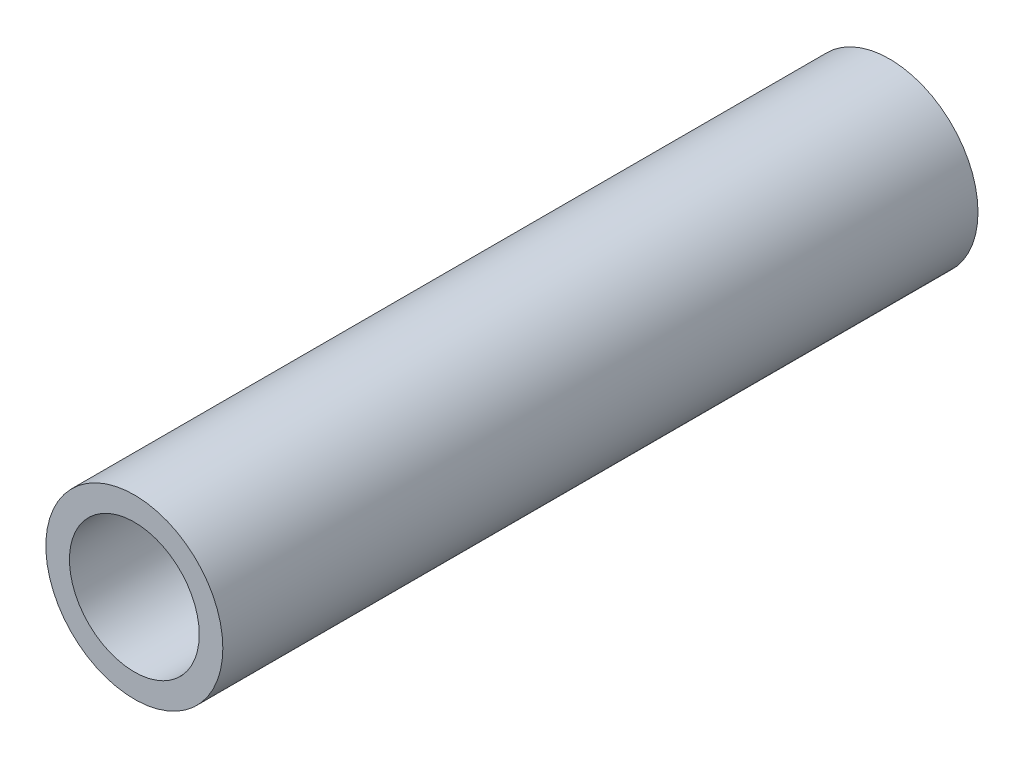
from build123d import *

# Parameters (mm, degrees)
ESQUISSE1_R          = 7.5
ESQUISSE1_R_2        = 5.5
BASE_EXTRUSION_DEPTH = 64


with BuildPart() as part:
    # Esquisse1 → Base-Extrusion (new body)
    with BuildSketch(Plane.XY):
        Circle(ESQUISSE1_R)
        Circle(ESQUISSE1_R_2, mode=Mode.SUBTRACT)
    extrude(amount=BASE_EXTRUSION_DEPTH)


solid = part.part
